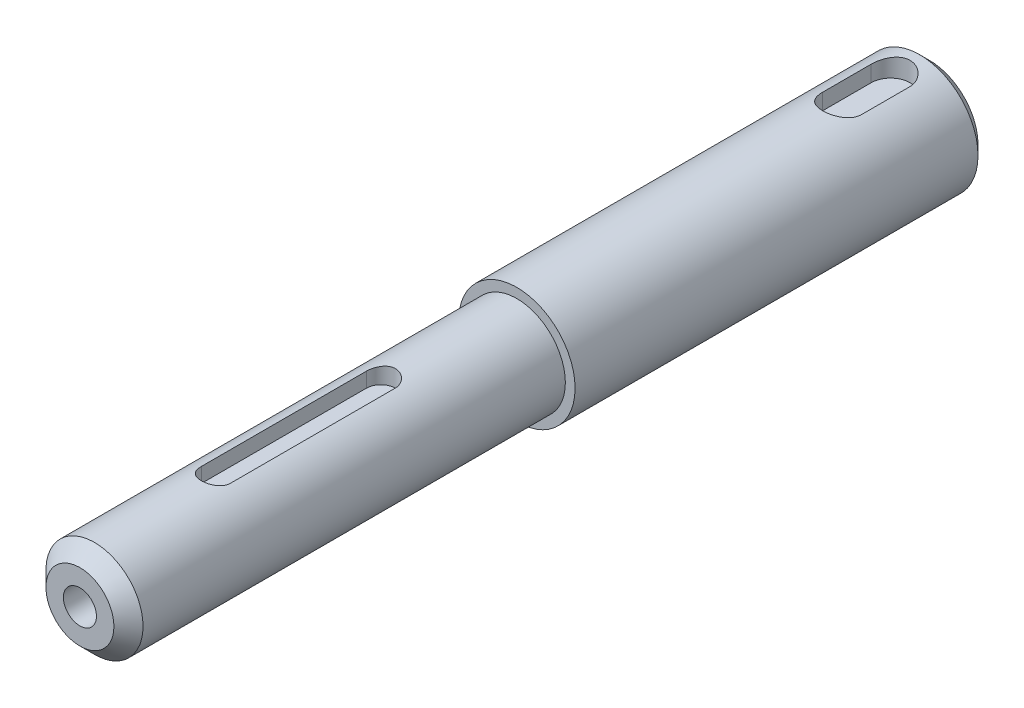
ISO-10303-21;
HEADER;
FILE_DESCRIPTION(('STEP AP214'),'2;1');
FILE_NAME('part.step','',(''),(''),'','','');
FILE_SCHEMA(('AUTOMOTIVE_DESIGN { 1 0 10303 214 1 1 1 1 }'));
ENDSEC;
DATA;
#1=APPLICATION_CONTEXT('core data for automotive mechanical design processes');
#2=APPLICATION_PROTOCOL_DEFINITION('international standard','automotive_design',2000,#1);
#3=PRODUCT_CONTEXT('',#1,'mechanical');
#4=PRODUCT('Part','Part','',(#3));
#5=PRODUCT_RELATED_PRODUCT_CATEGORY('part','',(#4));
#6=PRODUCT_DEFINITION_FORMATION('','',#4);
#7=PRODUCT_DEFINITION_CONTEXT('part definition',#1,'design');
#8=PRODUCT_DEFINITION('design','',#6,#7);
#9=PRODUCT_DEFINITION_SHAPE('','',#8);
#10=(LENGTH_UNIT() NAMED_UNIT(*) SI_UNIT(.MILLI.,.METRE.));
#11=(NAMED_UNIT(*) PLANE_ANGLE_UNIT() SI_UNIT($,.RADIAN.));
#12=(NAMED_UNIT(*) SI_UNIT($,.STERADIAN.) SOLID_ANGLE_UNIT());
#13=UNCERTAINTY_MEASURE_WITH_UNIT(LENGTH_MEASURE(1.E-05),#10,'distance_accuracy_value','');
#14=(GEOMETRIC_REPRESENTATION_CONTEXT(3) GLOBAL_UNCERTAINTY_ASSIGNED_CONTEXT((#13)) GLOBAL_UNIT_ASSIGNED_CONTEXT((#10,
#11,#12)) REPRESENTATION_CONTEXT('',''));
#15=CARTESIAN_POINT('',(0.,0.,0.));
#16=DIRECTION('',(0.,0.,1.));
#17=DIRECTION('',(1.,0.,0.));
#18=AXIS2_PLACEMENT_3D('',#15,#16,#17);
#19=CARTESIAN_POINT('',(0.,0.,85.));
#20=DIRECTION('',(0.,0.,-1.));
#21=DIRECTION('',(-1.,0.,0.));
#22=AXIS2_PLACEMENT_3D('',#19,#20,#21);
#23=CYLINDRICAL_SURFACE('',#22,12.);
#24=CARTESIAN_POINT('',(0.,0.,1.99999999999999));
#25=DIRECTION('',(0.,0.,1.));
#26=DIRECTION('',(1.,0.,0.));
#27=AXIS2_PLACEMENT_3D('',#24,#25,#26);
#28=CIRCLE('',#27,12.);
#29=CARTESIAN_POINT('',(12.,0.,1.99999999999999));
#30=VERTEX_POINT('',#29);
#31=EDGE_CURVE('E163',#30,#30,#28,.T.);
#32=ORIENTED_EDGE('',*,*,#31,.T.);
#33=EDGE_LOOP('',(#32));
#34=FACE_BOUND('',#33,.T.);
#35=CARTESIAN_POINT('',(0.,0.,85.));
#36=DIRECTION('',(0.,0.,1.));
#37=DIRECTION('',(1.,0.,0.));
#38=AXIS2_PLACEMENT_3D('',#35,#36,#37);
#39=CIRCLE('',#38,12.);
#40=CARTESIAN_POINT('',(12.,0.,85.));
#41=VERTEX_POINT('',#40);
#42=EDGE_CURVE('E154',#41,#41,#39,.T.);
#43=ORIENTED_EDGE('',*,*,#42,.F.);
#44=EDGE_LOOP('',(#43));
#45=FACE_BOUND('',#44,.T.);
#46=DIRECTION('',(0.,0.,-1.));
#47=VECTOR('',#46,1.);
#48=CARTESIAN_POINT('',(-3.99999999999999,11.3137084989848,85.));
#49=LINE('',#48,#47);
#50=CARTESIAN_POINT('',(-3.99999999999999,11.3137084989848,8.00000000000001));
#51=VERTEX_POINT('',#50);
#52=CARTESIAN_POINT('',(-4.,11.3137084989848,18.));
#53=VERTEX_POINT('',#52);
#54=EDGE_CURVE('E11',#51,#53,#49,.F.);
#55=ORIENTED_EDGE('',*,*,#54,.F.);
#56=CARTESIAN_POINT('',(0.,12.,4.));
#57=CARTESIAN_POINT('',(-0.218253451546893,12.0000006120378,3.99999898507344));
#58=CARTESIAN_POINT('',(-0.436500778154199,11.9939907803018,4.01792106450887));
#59=CARTESIAN_POINT('',(-0.866567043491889,11.9706084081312,4.08891643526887));
#60=CARTESIAN_POINT('',(-1.07838531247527,11.9532346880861,4.14199337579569));
#61=CARTESIAN_POINT('',(-1.4893311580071,11.9090123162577,4.28127697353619));
#62=CARTESIAN_POINT('',(-1.68847930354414,11.8821795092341,4.36742824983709));
#63=CARTESIAN_POINT('',(-2.0694997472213,11.8217778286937,4.57016469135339));
#64=CARTESIAN_POINT('',(-2.25136862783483,11.7882076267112,4.6867558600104));
#65=CARTESIAN_POINT('',(-2.59896670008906,11.7165637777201,4.95130321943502));
#66=CARTESIAN_POINT('',(-2.76401480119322,11.6783822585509,5.100124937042));
#67=CARTESIAN_POINT('',(-3.06733077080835,11.6024125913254,5.42306861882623));
#68=CARTESIAN_POINT('',(-3.20559274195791,11.5646245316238,5.59719613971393));
#69=CARTESIAN_POINT('',(-3.45529976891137,11.4925332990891,5.97194046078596));
#70=CARTESIAN_POINT('',(-3.56585943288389,11.4583615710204,6.17317495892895));
#71=CARTESIAN_POINT('',(-3.75127549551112,11.3990122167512,6.59270437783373));
#72=CARTESIAN_POINT('',(-3.82614278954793,11.3738318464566,6.81099406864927));
#73=CARTESIAN_POINT('',(-3.93549384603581,11.3364521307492,7.25069288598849));
#74=CARTESIAN_POINT('',(-3.97125379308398,11.3238438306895,7.47174883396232));
#75=CARTESIAN_POINT('',(-4.005364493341,11.3118262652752,7.91705501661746));
#76=CARTESIAN_POINT('',(-4.0037268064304,11.312412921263,8.14130424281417));
#77=CARTESIAN_POINT('',(-3.96407961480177,11.3263605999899,8.57574652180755));
#78=CARTESIAN_POINT('',(-3.92773565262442,11.3391366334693,8.78611361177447));
#79=CARTESIAN_POINT('',(-3.82242465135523,11.3750663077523,9.19757367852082));
#80=CARTESIAN_POINT('',(-3.75345370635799,11.3982211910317,9.39866554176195));
#81=CARTESIAN_POINT('',(-3.58375623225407,11.4527164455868,9.78965099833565));
#82=CARTESIAN_POINT('',(-3.4825361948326,11.4841826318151,9.97931210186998));
#83=CARTESIAN_POINT('',(-3.25155642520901,11.5517023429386,10.339483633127));
#84=CARTESIAN_POINT('',(-3.12178844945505,11.5877571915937,10.5099885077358));
#85=CARTESIAN_POINT('',(-2.82939733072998,11.6626931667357,10.8363663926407));
#86=CARTESIAN_POINT('',(-2.66541260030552,11.7016235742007,10.9910107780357));
#87=CARTESIAN_POINT('',(-2.31335827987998,11.7762775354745,11.2709250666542));
#88=CARTESIAN_POINT('',(-2.12528638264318,11.8120007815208,11.3961921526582));
#89=CARTESIAN_POINT('',(-1.72779045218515,11.8766843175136,11.6147852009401));
#90=CARTESIAN_POINT('',(-1.51817310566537,11.9055740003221,11.7077819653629));
#91=CARTESIAN_POINT('',(-1.08507633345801,11.9528226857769,11.8568126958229));
#92=CARTESIAN_POINT('',(-0.861601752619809,11.971185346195,11.9128595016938));
#93=CARTESIAN_POINT('',(-0.41753531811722,11.9947050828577,11.9842226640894));
#94=CARTESIAN_POINT('',(-0.197238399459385,12.0004000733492,12.001199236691));
#95=CARTESIAN_POINT('',(0.243100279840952,11.9995561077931,11.9986693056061));
#96=CARTESIAN_POINT('',(0.463142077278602,11.9930192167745,11.9791689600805));
#97=CARTESIAN_POINT('',(0.890079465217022,11.9688009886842,11.9055523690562));
#98=CARTESIAN_POINT('',(1.09717122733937,11.9514479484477,11.852455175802));
#99=CARTESIAN_POINT('',(1.49942383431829,11.9076738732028,11.7144262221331));
#100=CARTESIAN_POINT('',(1.69458315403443,11.881251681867,11.6294904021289));
#101=CARTESIAN_POINT('',(2.07315318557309,11.8211572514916,11.4277182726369));
#102=CARTESIAN_POINT('',(2.25611983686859,11.7873125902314,11.3101016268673));
#103=CARTESIAN_POINT('',(2.60025932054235,11.7162101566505,11.0472233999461));
#104=CARTESIAN_POINT('',(2.76142547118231,11.6789513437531,10.9019533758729));
#105=CARTESIAN_POINT('',(3.0650100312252,11.6030739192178,10.5800849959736));
#106=CARTESIAN_POINT('',(3.20624387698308,11.5644704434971,10.4023630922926));
#107=CARTESIAN_POINT('',(3.4570300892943,11.4919989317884,10.0249137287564));
#108=CARTESIAN_POINT('',(3.56658219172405,11.4581309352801,9.8251860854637));
#109=CARTESIAN_POINT('',(3.75038772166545,11.3992956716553,9.40930793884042));
#110=CARTESIAN_POINT('',(3.82471252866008,11.3743104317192,9.19319168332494));
#111=CARTESIAN_POINT('',(3.93557866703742,11.336433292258,8.75048539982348));
#112=CARTESIAN_POINT('',(3.97213701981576,11.3235359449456,8.5239001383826));
#113=CARTESIAN_POINT('',(4.00510512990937,11.3119143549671,8.07921161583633));
#114=CARTESIAN_POINT('',(4.0034810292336,11.3124960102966,7.86127063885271));
#115=CARTESIAN_POINT('',(3.96496917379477,11.3260507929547,7.42893970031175));
#116=CARTESIAN_POINT('',(3.92808351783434,11.3390231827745,7.21454952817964));
#117=CARTESIAN_POINT('',(3.82148725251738,11.3753809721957,6.79945734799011));
#118=CARTESIAN_POINT('',(3.75241338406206,11.3985639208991,6.59857269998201));
#119=CARTESIAN_POINT('',(3.58391746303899,11.4526559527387,6.21109037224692));
#120=CARTESIAN_POINT('',(3.48448867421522,11.4835667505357,6.02449587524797));
#121=CARTESIAN_POINT('',(3.25304277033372,11.5513131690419,5.66206532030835));
#122=CARTESIAN_POINT('',(3.11979297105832,11.5883484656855,5.48705399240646));
#123=CARTESIAN_POINT('',(2.82657153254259,11.6633342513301,5.1612407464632));
#124=CARTESIAN_POINT('',(2.66659233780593,11.7012849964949,5.0104456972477));
#125=CARTESIAN_POINT('',(2.31696622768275,11.7756012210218,4.73142235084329));
#126=CARTESIAN_POINT('',(2.12640605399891,11.8118472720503,4.604302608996));
#127=CARTESIAN_POINT('',(1.7254294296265,11.8770396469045,4.38403828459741));
#128=CARTESIAN_POINT('',(1.51501807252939,11.9059878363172,4.29088501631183));
#129=CARTESIAN_POINT('',(1.0899745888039,11.9522206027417,4.14511347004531));
#130=CARTESIAN_POINT('',(0.875951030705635,11.9699684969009,4.09087013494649));
#131=CARTESIAN_POINT('',(0.441281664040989,11.9938562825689,4.0183188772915));
#132=CARTESIAN_POINT('',(0.220637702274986,11.9999993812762,4.00000102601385));
#133=CARTESIAN_POINT('',(0.,12.,4.));
#134=B_SPLINE_CURVE_WITH_KNOTS('',3,(#56,#57,#58,#59,#60,#61,#62,#63,#64,#65,#66,#67,#68,#69,
#70,#71,#72,#73,#74,#75,#76,#77,#78,#79,#80,#81,#82,#83,#84,#85,#86,#87,#88,#89,#90,#91,#92,#93,
#94,#95,#96,#97,#98,#99,#100,#101,#102,#103,#104,#105,#106,#107,#108,#109,#110,#111,#112,#113,
#114,#115,#116,#117,#118,#119,#120,#121,#122,#123,#124,#125,#126,#127,#128,#129,#130,#131,#132,
#133),.UNSPECIFIED.,.T.,.F.,(4,2,2,2,2,2,2,2,2,2,2,2,2,2,2,2,2,2,2,2,2,2,2,2,2,2,2,2,2,2,2,2,2,
2,2,2,2,2,4),(0.,0.653948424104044,1.30796474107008,1.96089069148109,2.6139455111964,
3.28738737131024,3.96097733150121,4.65393539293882,5.34668178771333,6.0160770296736,
6.68526535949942,7.32387306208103,7.96255723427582,8.61152684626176,9.26068410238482,
9.94373223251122,10.6268458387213,11.3167362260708,12.0063867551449,12.6661433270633,
13.3257885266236,13.9663263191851,14.6069458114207,15.264415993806,15.9220872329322,
16.6096409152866,17.2972003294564,17.9833605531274,18.6692113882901,19.3198266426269,
19.9704031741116,20.6086234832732,21.2469855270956,21.9132026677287,22.5796084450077,
23.2719864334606,23.9641872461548,24.6254623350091,25.2865546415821),.UNSPECIFIED.);
#135=CARTESIAN_POINT('',(4.,11.3137084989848,8.));
#136=VERTEX_POINT('',#135);
#137=EDGE_CURVE('E41',#136,#51,#134,.T.);
#138=ORIENTED_EDGE('',*,*,#137,.F.);
#139=DIRECTION('',(0.,0.,-1.));
#140=VECTOR('',#139,1.);
#141=CARTESIAN_POINT('',(4.00000000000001,11.3137084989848,85.));
#142=LINE('',#141,#140);
#143=CARTESIAN_POINT('',(4.,11.3137084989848,18.));
#144=VERTEX_POINT('',#143);
#145=EDGE_CURVE('E210',#144,#136,#142,.T.);
#146=ORIENTED_EDGE('',*,*,#145,.F.);
#147=CARTESIAN_POINT('',(0.,12.,14.));
#148=CARTESIAN_POINT('',(-0.218253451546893,12.0000006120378,13.9999989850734));
#149=CARTESIAN_POINT('',(-0.436500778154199,11.9939907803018,14.0179210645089));
#150=CARTESIAN_POINT('',(-0.866567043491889,11.9706084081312,14.0889164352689));
#151=CARTESIAN_POINT('',(-1.07838531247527,11.9532346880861,14.1419933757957));
#152=CARTESIAN_POINT('',(-1.4893311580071,11.9090123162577,14.2812769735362));
#153=CARTESIAN_POINT('',(-1.68847930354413,11.8821795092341,14.3674282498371));
#154=CARTESIAN_POINT('',(-2.0694997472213,11.8217778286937,14.5701646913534));
#155=CARTESIAN_POINT('',(-2.25136862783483,11.7882076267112,14.6867558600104));
#156=CARTESIAN_POINT('',(-2.59896670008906,11.7165637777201,14.951303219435));
#157=CARTESIAN_POINT('',(-2.76401480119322,11.6783822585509,15.100124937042));
#158=CARTESIAN_POINT('',(-3.06733077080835,11.6024125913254,15.4230686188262));
#159=CARTESIAN_POINT('',(-3.20559274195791,11.5646245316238,15.5971961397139));
#160=CARTESIAN_POINT('',(-3.45529976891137,11.4925332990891,15.971940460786));
#161=CARTESIAN_POINT('',(-3.56585943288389,11.4583615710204,16.1731749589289));
#162=CARTESIAN_POINT('',(-3.75127549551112,11.3990122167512,16.5927043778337));
#163=CARTESIAN_POINT('',(-3.82614278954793,11.3738318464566,16.8109940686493));
#164=CARTESIAN_POINT('',(-3.93549384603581,11.3364521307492,17.2506928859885));
#165=CARTESIAN_POINT('',(-3.97125379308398,11.3238438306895,17.4717488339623));
#166=CARTESIAN_POINT('',(-4.005364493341,11.3118262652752,17.9170550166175));
#167=CARTESIAN_POINT('',(-4.0037268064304,11.312412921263,18.1413042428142));
#168=CARTESIAN_POINT('',(-3.96407961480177,11.3263605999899,18.5757465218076));
#169=CARTESIAN_POINT('',(-3.92773565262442,11.3391366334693,18.7861136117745));
#170=CARTESIAN_POINT('',(-3.82242465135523,11.3750663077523,19.1975736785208));
#171=CARTESIAN_POINT('',(-3.75345370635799,11.3982211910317,19.3986655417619));
#172=CARTESIAN_POINT('',(-3.58375623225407,11.4527164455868,19.7896509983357));
#173=CARTESIAN_POINT('',(-3.4825361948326,11.4841826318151,19.97931210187));
#174=CARTESIAN_POINT('',(-3.25155642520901,11.5517023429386,20.339483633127));
#175=CARTESIAN_POINT('',(-3.12178844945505,11.5877571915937,20.5099885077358));
#176=CARTESIAN_POINT('',(-2.82939733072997,11.6626931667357,20.8363663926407));
#177=CARTESIAN_POINT('',(-2.66541260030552,11.7016235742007,20.9910107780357));
#178=CARTESIAN_POINT('',(-2.31335827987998,11.7762775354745,21.2709250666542));
#179=CARTESIAN_POINT('',(-2.12528638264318,11.8120007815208,21.3961921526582));
#180=CARTESIAN_POINT('',(-1.72779045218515,11.8766843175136,21.6147852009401));
#181=CARTESIAN_POINT('',(-1.51817310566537,11.9055740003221,21.7077819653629));
#182=CARTESIAN_POINT('',(-1.08507633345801,11.9528226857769,21.8568126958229));
#183=CARTESIAN_POINT('',(-0.86160175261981,11.971185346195,21.9128595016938));
#184=CARTESIAN_POINT('',(-0.417535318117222,11.9947050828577,21.9842226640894));
#185=CARTESIAN_POINT('',(-0.197238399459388,12.0004000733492,22.001199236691));
#186=CARTESIAN_POINT('',(0.24310027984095,11.9995561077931,21.9986693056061));
#187=CARTESIAN_POINT('',(0.463142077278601,11.9930192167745,21.9791689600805));
#188=CARTESIAN_POINT('',(0.890079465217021,11.9688009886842,21.9055523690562));
#189=CARTESIAN_POINT('',(1.09717122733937,11.9514479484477,21.852455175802));
#190=CARTESIAN_POINT('',(1.49942383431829,11.9076738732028,21.7144262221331));
#191=CARTESIAN_POINT('',(1.69458315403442,11.881251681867,21.6294904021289));
#192=CARTESIAN_POINT('',(2.07315318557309,11.8211572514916,21.4277182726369));
#193=CARTESIAN_POINT('',(2.25611983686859,11.7873125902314,21.3101016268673));
#194=CARTESIAN_POINT('',(2.60025932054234,11.7162101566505,21.0472233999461));
#195=CARTESIAN_POINT('',(2.76142547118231,11.6789513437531,20.9019533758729));
#196=CARTESIAN_POINT('',(3.0650100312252,11.6030739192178,20.5800849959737));
#197=CARTESIAN_POINT('',(3.20624387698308,11.5644704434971,20.4023630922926));
#198=CARTESIAN_POINT('',(3.45703008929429,11.4919989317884,20.0249137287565));
#199=CARTESIAN_POINT('',(3.56658219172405,11.4581309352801,19.8251860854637));
#200=CARTESIAN_POINT('',(3.75038772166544,11.3992956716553,19.4093079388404));
#201=CARTESIAN_POINT('',(3.82471252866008,11.3743104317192,19.1931916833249));
#202=CARTESIAN_POINT('',(3.93557866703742,11.336433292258,18.7504853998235));
#203=CARTESIAN_POINT('',(3.97213701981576,11.3235359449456,18.5239001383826));
#204=CARTESIAN_POINT('',(4.00510512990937,11.3119143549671,18.0792116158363));
#205=CARTESIAN_POINT('',(4.0034810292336,11.3124960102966,17.8612706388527));
#206=CARTESIAN_POINT('',(3.96496917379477,11.3260507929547,17.4289397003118));
#207=CARTESIAN_POINT('',(3.92808351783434,11.3390231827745,17.2145495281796));
#208=CARTESIAN_POINT('',(3.82148725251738,11.3753809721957,16.7994573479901));
#209=CARTESIAN_POINT('',(3.75241338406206,11.3985639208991,16.598572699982));
#210=CARTESIAN_POINT('',(3.58391746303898,11.4526559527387,16.2110903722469));
#211=CARTESIAN_POINT('',(3.48448867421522,11.4835667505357,16.024495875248));
#212=CARTESIAN_POINT('',(3.25304277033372,11.5513131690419,15.6620653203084));
#213=CARTESIAN_POINT('',(3.11979297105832,11.5883484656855,15.4870539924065));
#214=CARTESIAN_POINT('',(2.82657153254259,11.6633342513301,15.1612407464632));
#215=CARTESIAN_POINT('',(2.66659233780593,11.7012849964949,15.0104456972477));
#216=CARTESIAN_POINT('',(2.31696622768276,11.7756012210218,14.7314223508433));
#217=CARTESIAN_POINT('',(2.12640605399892,11.8118472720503,14.604302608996));
#218=CARTESIAN_POINT('',(1.7254294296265,11.8770396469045,14.3840382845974));
#219=CARTESIAN_POINT('',(1.5150180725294,11.9059878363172,14.2908850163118));
#220=CARTESIAN_POINT('',(1.0899745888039,11.9522206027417,14.1451134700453));
#221=CARTESIAN_POINT('',(0.875951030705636,11.9699684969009,14.0908701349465));
#222=CARTESIAN_POINT('',(0.441281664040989,11.9938562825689,14.0183188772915));
#223=CARTESIAN_POINT('',(0.220637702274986,11.9999993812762,14.0000010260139));
#224=CARTESIAN_POINT('',(0.,12.,14.));
#225=B_SPLINE_CURVE_WITH_KNOTS('',3,(#147,#148,#149,#150,#151,#152,#153,#154,#155,#156,#157,
#158,#159,#160,#161,#162,#163,#164,#165,#166,#167,#168,#169,#170,#171,#172,#173,#174,#175,#176,
#177,#178,#179,#180,#181,#182,#183,#184,#185,#186,#187,#188,#189,#190,#191,#192,#193,#194,#195,
#196,#197,#198,#199,#200,#201,#202,#203,#204,#205,#206,#207,#208,#209,#210,#211,#212,#213,#214,
#215,#216,#217,#218,#219,#220,#221,#222,#223,#224),.UNSPECIFIED.,.T.,.F.,(4,2,2,2,2,2,2,2,2,2,2,
2,2,2,2,2,2,2,2,2,2,2,2,2,2,2,2,2,2,2,2,2,2,2,2,2,2,2,4),(0.,0.653948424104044,1.30796474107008,
1.96089069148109,2.6139455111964,3.28738737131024,3.96097733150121,4.65393539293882,
5.34668178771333,6.0160770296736,6.68526535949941,7.32387306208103,7.96255723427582,
8.61152684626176,9.26068410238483,9.94373223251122,10.6268458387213,11.3167362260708,
12.0063867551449,12.6661433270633,13.3257885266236,13.9663263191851,14.6069458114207,
15.264415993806,15.9220872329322,16.6096409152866,17.2972003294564,17.9833605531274,
18.6692113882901,19.3198266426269,19.9704031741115,20.6086234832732,21.2469855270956,
21.9132026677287,22.5796084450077,23.2719864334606,23.9641872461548,24.6254623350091,
25.2865546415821),.UNSPECIFIED.);
#226=EDGE_CURVE('E34',#53,#144,#225,.T.);
#227=ORIENTED_EDGE('',*,*,#226,.F.);
#228=EDGE_LOOP('',(#55,#138,#146,#227));
#229=FACE_BOUND('',#228,.T.);
#230=ADVANCED_FACE('F26',(#34,#45,#229),#23,.T.);
#231=CARTESIAN_POINT('',(0.,0.,175.));
#232=DIRECTION('',(0.,0.,-1.));
#233=DIRECTION('',(-1.,0.,0.));
#234=AXIS2_PLACEMENT_3D('',#231,#232,#233);
#235=CYLINDRICAL_SURFACE('',#234,10.);
#236=CARTESIAN_POINT('',(0.,0.,85.));
#237=DIRECTION('',(0.,0.,1.));
#238=DIRECTION('',(1.,0.,0.));
#239=AXIS2_PLACEMENT_3D('',#236,#237,#238);
#240=CIRCLE('',#239,10.);
#241=CARTESIAN_POINT('',(10.,0.,85.));
#242=VERTEX_POINT('',#241);
#243=EDGE_CURVE('E151',#242,#242,#240,.T.);
#244=ORIENTED_EDGE('',*,*,#243,.T.);
#245=EDGE_LOOP('',(#244));
#246=FACE_BOUND('',#245,.T.);
#247=CARTESIAN_POINT('',(0.,0.,172.));
#248=DIRECTION('',(0.,0.,1.));
#249=DIRECTION('',(1.,0.,0.));
#250=AXIS2_PLACEMENT_3D('',#247,#248,#249);
#251=CIRCLE('',#250,10.);
#252=CARTESIAN_POINT('',(10.,0.,172.));
#253=VERTEX_POINT('',#252);
#254=EDGE_CURVE('E160',#253,#253,#251,.F.);
#255=ORIENTED_EDGE('',*,*,#254,.T.);
#256=EDGE_LOOP('',(#255));
#257=FACE_BOUND('',#256,.T.);
#258=CARTESIAN_POINT('',(0.,10.,144.));
#259=CARTESIAN_POINT('',(-0.1645772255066,9.999998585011,144.00000199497));
#260=CARTESIAN_POINT('',(-0.329174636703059,9.99589831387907,144.013587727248));
#261=CARTESIAN_POINT('',(-0.653576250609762,9.97994211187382,144.067442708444));
#262=CARTESIAN_POINT('',(-0.813379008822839,9.96808386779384,144.107719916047));
#263=CARTESIAN_POINT('',(-1.12346541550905,9.93791105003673,144.213492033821));
#264=CARTESIAN_POINT('',(-1.27376272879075,9.91960600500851,144.278949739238));
#265=CARTESIAN_POINT('',(-1.56124836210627,9.8784421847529,144.433072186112));
#266=CARTESIAN_POINT('',(-1.69843493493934,9.85558280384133,144.521740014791));
#267=CARTESIAN_POINT('',(-1.95974359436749,9.80701474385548,144.722448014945));
#268=CARTESIAN_POINT('',(-2.08343614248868,9.78124767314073,144.835033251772));
#269=CARTESIAN_POINT('',(-2.31049841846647,9.73011668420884,145.07921845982));
#270=CARTESIAN_POINT('',(-2.41386472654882,9.70475283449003,145.21082162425));
#271=CARTESIAN_POINT('',(-2.59960075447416,9.65668227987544,145.492941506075));
#272=CARTESIAN_POINT('',(-2.68144618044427,9.63404813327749,145.643816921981));
#273=CARTESIAN_POINT('',(-2.8184278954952,9.59487240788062,145.957978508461));
#274=CARTESIAN_POINT('',(-2.87357059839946,9.57832936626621,146.121261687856));
#275=CARTESIAN_POINT('',(-2.95403267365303,9.55381741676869,146.450780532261));
#276=CARTESIAN_POINT('',(-2.98014392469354,9.54562138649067,146.616805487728));
#277=CARTESIAN_POINT('',(-3.00427461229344,9.53805579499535,146.951066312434));
#278=CARTESIAN_POINT('',(-3.00230085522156,9.53868409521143,147.119301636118));
#279=CARTESIAN_POINT('',(-2.97093954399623,9.54849488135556,147.446767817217));
#280=CARTESIAN_POINT('',(-2.9425441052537,9.55736777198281,147.606104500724));
#281=CARTESIAN_POINT('',(-2.86074840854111,9.58216712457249,147.917639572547));
#282=CARTESIAN_POINT('',(-2.80734568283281,9.59809428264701,148.069837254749));
#283=CARTESIAN_POINT('',(-2.67632053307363,9.63545466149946,148.365200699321));
#284=CARTESIAN_POINT('',(-2.59837633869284,9.65696032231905,148.508214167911));
#285=CARTESIAN_POINT('',(-2.42070445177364,9.7030197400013,148.77946404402));
#286=CARTESIAN_POINT('',(-2.32097148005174,9.72757423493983,148.907696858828));
#287=CARTESIAN_POINT('',(-2.09762581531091,9.77822022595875,149.151372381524));
#288=CARTESIAN_POINT('',(-1.97318981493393,9.80433308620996,149.266057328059));
#289=CARTESIAN_POINT('',(-1.70652651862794,9.85424488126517,149.473107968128));
#290=CARTESIAN_POINT('',(-1.56429810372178,9.8780436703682,149.565472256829));
#291=CARTESIAN_POINT('',(-1.2647100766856,9.92086320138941,149.725719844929));
#292=CARTESIAN_POINT('',(-1.1072554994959,9.93985087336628,149.7934350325));
#293=CARTESIAN_POINT('',(-0.78249083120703,9.97067043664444,149.901199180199));
#294=CARTESIAN_POINT('',(-0.615183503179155,9.98250432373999,149.941255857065));
#295=CARTESIAN_POINT('',(-0.281904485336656,9.99736729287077,149.991304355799));
#296=CARTESIAN_POINT('',(-0.116100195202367,10.0006970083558,150.002323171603));
#297=CARTESIAN_POINT('',(0.214999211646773,9.99905846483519,149.996861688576));
#298=CARTESIAN_POINT('',(0.380294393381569,9.99409131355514,149.980385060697));
#299=CARTESIAN_POINT('',(0.701807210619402,9.97661393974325,149.921230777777));
#300=CARTESIAN_POINT('',(0.858145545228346,9.96427659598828,149.879153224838));
#301=CARTESIAN_POINT('',(1.16150927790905,9.9334869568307,149.770713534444));
#302=CARTESIAN_POINT('',(1.30853355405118,9.91503392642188,149.704348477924));
#303=CARTESIAN_POINT('',(1.59287437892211,9.87339308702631,149.547493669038));
#304=CARTESIAN_POINT('',(1.72988765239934,9.8501056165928,149.456481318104));
#305=CARTESIAN_POINT('',(1.9870466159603,9.80146937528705,149.253550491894));
#306=CARTESIAN_POINT('',(2.10718806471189,9.7761200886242,149.141626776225));
#307=CARTESIAN_POINT('',(2.33171489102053,9.72506343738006,148.895225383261));
#308=CARTESIAN_POINT('',(2.43536962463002,9.69937650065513,148.760076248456));
#309=CARTESIAN_POINT('',(2.61857990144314,9.65153030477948,148.473744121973));
#310=CARTESIAN_POINT('',(2.69813607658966,9.62937095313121,148.322561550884));
#311=CARTESIAN_POINT('',(2.83034694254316,9.5913437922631,148.00893501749));
#312=CARTESIAN_POINT('',(2.88312693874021,9.57544675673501,147.846547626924));
#313=CARTESIAN_POINT('',(2.96043461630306,9.55183188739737,147.514624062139));
#314=CARTESIAN_POINT('',(2.98497197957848,9.54411125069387,147.345090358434));
#315=CARTESIAN_POINT('',(3.0044396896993,9.53799944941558,147.011276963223));
#316=CARTESIAN_POINT('',(3.00056110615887,9.53923294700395,146.847072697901));
#317=CARTESIAN_POINT('',(2.9661501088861,9.54998802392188,146.521771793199));
#318=CARTESIAN_POINT('',(2.93561876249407,9.55950927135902,146.360675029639));
#319=CARTESIAN_POINT('',(2.84953777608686,9.58551527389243,146.048109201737));
#320=CARTESIAN_POINT('',(2.79430351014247,9.60191209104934,145.896545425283));
#321=CARTESIAN_POINT('',(2.66063014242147,9.63980557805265,145.604715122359));
#322=CARTESIAN_POINT('',(2.58218659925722,9.6613032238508,145.464450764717));
#323=CARTESIAN_POINT('',(2.40097527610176,9.70795352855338,145.193673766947));
#324=CARTESIAN_POINT('',(2.29742552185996,9.7332108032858,145.06370247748));
#325=CARTESIAN_POINT('',(2.07034869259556,9.78402640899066,144.822595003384));
#326=CARTESIAN_POINT('',(1.94681643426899,9.80958481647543,144.711463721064));
#327=CARTESIAN_POINT('',(1.67893152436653,9.85901873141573,144.50795317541));
#328=CARTESIAN_POINT('',(1.53407577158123,9.88282319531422,144.416217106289));
#329=CARTESIAN_POINT('',(1.23028274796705,9.92521360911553,144.258529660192));
#330=CARTESIAN_POINT('',(1.07135210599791,9.94380199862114,144.192566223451));
#331=CARTESIAN_POINT('',(0.761515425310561,9.97204349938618,144.094209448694));
#332=CARTESIAN_POINT('',(0.611573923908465,9.9824405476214,144.058976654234));
#333=CARTESIAN_POINT('',(0.307760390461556,9.9964188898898,144.011872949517));
#334=CARTESIAN_POINT('',(0.153889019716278,10.0000013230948,143.99999813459));
#335=CARTESIAN_POINT('',(0.,10.,144.));
#336=B_SPLINE_CURVE_WITH_KNOTS('',3,(#258,#259,#260,#261,#262,#263,#264,#265,#266,#267,#268,
#269,#270,#271,#272,#273,#274,#275,#276,#277,#278,#279,#280,#281,#282,#283,#284,#285,#286,#287,
#288,#289,#290,#291,#292,#293,#294,#295,#296,#297,#298,#299,#300,#301,#302,#303,#304,#305,#306,
#307,#308,#309,#310,#311,#312,#313,#314,#315,#316,#317,#318,#319,#320,#321,#322,#323,#324,#325,
#326,#327,#328,#329,#330,#331,#332,#333,#334,#335),.UNSPECIFIED.,.T.,.F.,(4,2,2,2,2,2,2,2,2,2,2,
2,2,2,2,2,2,2,2,2,2,2,2,2,2,2,2,2,2,2,2,2,2,2,2,2,2,2,4),(0.,0.493166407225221,
0.986479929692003,1.47906735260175,1.9717203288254,2.47711205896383,2.98258874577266,
3.49942962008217,4.01614629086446,4.51839378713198,5.02051956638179,5.50452033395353,
5.98856887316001,6.47924852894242,6.97004720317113,7.48134208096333,7.99266913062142,
8.50742093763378,9.02202907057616,9.5181761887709,10.0142570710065,10.4991349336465,
10.9840710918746,11.4802261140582,11.9765056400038,12.4908080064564,13.0050968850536,
13.516956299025,14.0286401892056,14.5190031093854,15.0093463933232,15.4936008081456,
15.9779479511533,16.4799385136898,16.9820594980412,17.4988599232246,18.0154182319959,
18.4766338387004,18.9377723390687),.UNSPECIFIED.);
#337=CARTESIAN_POINT('',(-2.99999999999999,9.53939201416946,147.));
#338=VERTEX_POINT('',#337);
#339=CARTESIAN_POINT('',(3.,9.53939201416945,147.));
#340=VERTEX_POINT('',#339);
#341=EDGE_CURVE('E202',#338,#340,#336,.T.);
#342=ORIENTED_EDGE('',*,*,#341,.F.);
#343=DIRECTION('',(0.,0.,-1.));
#344=VECTOR('',#343,1.);
#345=CARTESIAN_POINT('',(-2.99999999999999,9.53939201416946,175.));
#346=LINE('',#345,#344);
#347=CARTESIAN_POINT('',(-2.99999999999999,9.53939201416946,113.));
#348=VERTEX_POINT('',#347);
#349=EDGE_CURVE('E169',#348,#338,#346,.F.);
#350=ORIENTED_EDGE('',*,*,#349,.F.);
#351=CARTESIAN_POINT('',(0.,10.,110.));
#352=CARTESIAN_POINT('',(-0.164577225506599,9.999998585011,110.00000199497));
#353=CARTESIAN_POINT('',(-0.329174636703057,9.99589831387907,110.013587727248));
#354=CARTESIAN_POINT('',(-0.65357625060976,9.97994211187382,110.067442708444));
#355=CARTESIAN_POINT('',(-0.813379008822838,9.96808386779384,110.107719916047));
#356=CARTESIAN_POINT('',(-1.12346541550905,9.93791105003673,110.213492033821));
#357=CARTESIAN_POINT('',(-1.27376272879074,9.91960600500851,110.278949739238));
#358=CARTESIAN_POINT('',(-1.56124836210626,9.87844218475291,110.433072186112));
#359=CARTESIAN_POINT('',(-1.69843493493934,9.85558280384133,110.521740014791));
#360=CARTESIAN_POINT('',(-1.95974359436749,9.80701474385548,110.722448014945));
#361=CARTESIAN_POINT('',(-2.08343614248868,9.78124767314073,110.835033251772));
#362=CARTESIAN_POINT('',(-2.31049841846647,9.73011668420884,111.07921845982));
#363=CARTESIAN_POINT('',(-2.41386472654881,9.70475283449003,111.21082162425));
#364=CARTESIAN_POINT('',(-2.59960075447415,9.65668227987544,111.492941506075));
#365=CARTESIAN_POINT('',(-2.68144618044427,9.63404813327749,111.643816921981));
#366=CARTESIAN_POINT('',(-2.8184278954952,9.59487240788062,111.957978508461));
#367=CARTESIAN_POINT('',(-2.87357059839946,9.57832936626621,112.121261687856));
#368=CARTESIAN_POINT('',(-2.95403267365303,9.55381741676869,112.450780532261));
#369=CARTESIAN_POINT('',(-2.98014392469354,9.54562138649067,112.616805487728));
#370=CARTESIAN_POINT('',(-3.00427461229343,9.53805579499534,112.951066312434));
#371=CARTESIAN_POINT('',(-3.00230085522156,9.53868409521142,113.119301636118));
#372=CARTESIAN_POINT('',(-2.97093954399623,9.54849488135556,113.446767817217));
#373=CARTESIAN_POINT('',(-2.9425441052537,9.55736777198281,113.606104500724));
#374=CARTESIAN_POINT('',(-2.86074840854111,9.58216712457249,113.917639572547));
#375=CARTESIAN_POINT('',(-2.80734568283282,9.59809428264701,114.069837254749));
#376=CARTESIAN_POINT('',(-2.67632053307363,9.63545466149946,114.365200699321));
#377=CARTESIAN_POINT('',(-2.59837633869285,9.65696032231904,114.508214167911));
#378=CARTESIAN_POINT('',(-2.42070445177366,9.70301974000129,114.77946404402));
#379=CARTESIAN_POINT('',(-2.32097148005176,9.72757423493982,114.907696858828));
#380=CARTESIAN_POINT('',(-2.09762581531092,9.77822022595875,115.151372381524));
#381=CARTESIAN_POINT('',(-1.97318981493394,9.80433308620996,115.266057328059));
#382=CARTESIAN_POINT('',(-1.70652651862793,9.85424488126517,115.473107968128));
#383=CARTESIAN_POINT('',(-1.56429810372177,9.8780436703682,115.565472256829));
#384=CARTESIAN_POINT('',(-1.2647100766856,9.92086320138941,115.725719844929));
#385=CARTESIAN_POINT('',(-1.1072554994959,9.93985087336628,115.7934350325));
#386=CARTESIAN_POINT('',(-0.782490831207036,9.97067043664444,115.901199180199));
#387=CARTESIAN_POINT('',(-0.615183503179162,9.98250432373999,115.941255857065));
#388=CARTESIAN_POINT('',(-0.281904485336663,9.99736729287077,115.991304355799));
#389=CARTESIAN_POINT('',(-0.116100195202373,10.0006970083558,116.002323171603));
#390=CARTESIAN_POINT('',(0.214999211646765,9.99905846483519,115.996861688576));
#391=CARTESIAN_POINT('',(0.380294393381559,9.99409131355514,115.980385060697));
#392=CARTESIAN_POINT('',(0.701807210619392,9.97661393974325,115.921230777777));
#393=CARTESIAN_POINT('',(0.85814554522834,9.96427659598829,115.879153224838));
#394=CARTESIAN_POINT('',(1.16150927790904,9.9334869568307,115.770713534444));
#395=CARTESIAN_POINT('',(1.30853355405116,9.91503392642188,115.704348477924));
#396=CARTESIAN_POINT('',(1.5928743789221,9.87339308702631,115.547493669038));
#397=CARTESIAN_POINT('',(1.72988765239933,9.8501056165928,115.456481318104));
#398=CARTESIAN_POINT('',(1.9870466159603,9.80146937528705,115.253550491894));
#399=CARTESIAN_POINT('',(2.10718806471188,9.7761200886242,115.141626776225));
#400=CARTESIAN_POINT('',(2.33171489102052,9.72506343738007,114.895225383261));
#401=CARTESIAN_POINT('',(2.43536962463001,9.69937650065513,114.760076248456));
#402=CARTESIAN_POINT('',(2.61857990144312,9.65153030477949,114.473744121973));
#403=CARTESIAN_POINT('',(2.69813607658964,9.62937095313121,114.322561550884));
#404=CARTESIAN_POINT('',(2.83034694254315,9.5913437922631,114.00893501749));
#405=CARTESIAN_POINT('',(2.88312693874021,9.57544675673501,113.846547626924));
#406=CARTESIAN_POINT('',(2.96043461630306,9.55183188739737,113.51462406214));
#407=CARTESIAN_POINT('',(2.98497197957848,9.54411125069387,113.345090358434));
#408=CARTESIAN_POINT('',(3.0044396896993,9.53799944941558,113.011276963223));
#409=CARTESIAN_POINT('',(3.00056110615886,9.53923294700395,112.847072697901));
#410=CARTESIAN_POINT('',(2.9661501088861,9.54998802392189,112.521771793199));
#411=CARTESIAN_POINT('',(2.93561876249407,9.55950927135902,112.360675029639));
#412=CARTESIAN_POINT('',(2.84953777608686,9.58551527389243,112.048109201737));
#413=CARTESIAN_POINT('',(2.79430351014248,9.60191209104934,111.896545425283));
#414=CARTESIAN_POINT('',(2.66063014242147,9.63980557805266,111.604715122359));
#415=CARTESIAN_POINT('',(2.58218659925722,9.6613032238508,111.464450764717));
#416=CARTESIAN_POINT('',(2.40097527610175,9.70795352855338,111.193673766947));
#417=CARTESIAN_POINT('',(2.29742552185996,9.7332108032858,111.06370247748));
#418=CARTESIAN_POINT('',(2.07034869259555,9.78402640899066,110.822595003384));
#419=CARTESIAN_POINT('',(1.94681643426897,9.80958481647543,110.711463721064));
#420=CARTESIAN_POINT('',(1.67893152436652,9.85901873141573,110.50795317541));
#421=CARTESIAN_POINT('',(1.53407577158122,9.88282319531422,110.416217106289));
#422=CARTESIAN_POINT('',(1.23028274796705,9.92521360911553,110.258529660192));
#423=CARTESIAN_POINT('',(1.0713521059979,9.94380199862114,110.192566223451));
#424=CARTESIAN_POINT('',(0.761515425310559,9.97204349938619,110.094209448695));
#425=CARTESIAN_POINT('',(0.611573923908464,9.9824405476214,110.058976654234));
#426=CARTESIAN_POINT('',(0.307760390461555,9.9964188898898,110.011872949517));
#427=CARTESIAN_POINT('',(0.153889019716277,10.0000013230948,109.99999813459));
#428=CARTESIAN_POINT('',(0.,10.,110.));
#429=B_SPLINE_CURVE_WITH_KNOTS('',3,(#351,#352,#353,#354,#355,#356,#357,#358,#359,#360,#361,
#362,#363,#364,#365,#366,#367,#368,#369,#370,#371,#372,#373,#374,#375,#376,#377,#378,#379,#380,
#381,#382,#383,#384,#385,#386,#387,#388,#389,#390,#391,#392,#393,#394,#395,#396,#397,#398,#399,
#400,#401,#402,#403,#404,#405,#406,#407,#408,#409,#410,#411,#412,#413,#414,#415,#416,#417,#418,
#419,#420,#421,#422,#423,#424,#425,#426,#427,#428),.UNSPECIFIED.,.T.,.F.,(4,2,2,2,2,2,2,2,2,2,2,
2,2,2,2,2,2,2,2,2,2,2,2,2,2,2,2,2,2,2,2,2,2,2,2,2,2,2,4),(0.,0.49316640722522,0.986479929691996,
1.47906735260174,1.9717203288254,2.47711205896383,2.98258874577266,3.49942962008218,
4.01614629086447,4.51839378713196,5.02051956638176,5.50452033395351,5.98856887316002,
6.47924852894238,6.9700472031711,7.48134208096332,7.99266913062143,8.50742093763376,
9.02202907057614,9.51817618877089,10.0142570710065,10.4991349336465,10.9840710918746,
11.4802261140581,11.9765056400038,12.4908080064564,13.0050968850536,13.516956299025,
14.0286401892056,14.5190031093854,15.0093463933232,15.4936008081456,15.9779479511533,
16.4799385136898,16.9820594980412,17.4988599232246,18.0154182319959,18.4766338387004,
18.9377723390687),.UNSPECIFIED.);
#430=CARTESIAN_POINT('',(3.,9.53939201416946,113.));
#431=VERTEX_POINT('',#430);
#432=EDGE_CURVE('E171',#431,#348,#429,.T.);
#433=ORIENTED_EDGE('',*,*,#432,.F.);
#434=DIRECTION('',(0.,0.,-1.));
#435=VECTOR('',#434,1.);
#436=CARTESIAN_POINT('',(3.,9.53939201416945,175.));
#437=LINE('',#436,#435);
#438=EDGE_CURVE('E177',#340,#431,#437,.T.);
#439=ORIENTED_EDGE('',*,*,#438,.F.);
#440=EDGE_LOOP('',(#342,#350,#433,#439));
#441=FACE_BOUND('',#440,.T.);
#442=ADVANCED_FACE('F179',(#246,#257,#441),#235,.T.);
#443=CARTESIAN_POINT('',(0.,0.,85.));
#444=DIRECTION('',(0.,0.,1.));
#445=DIRECTION('',(1.,0.,0.));
#446=AXIS2_PLACEMENT_3D('',#443,#444,#445);
#447=PLANE('',#446);
#448=ORIENTED_EDGE('',*,*,#42,.T.);
#449=EDGE_LOOP('',(#448));
#450=FACE_BOUND('',#449,.T.);
#451=ORIENTED_EDGE('',*,*,#243,.F.);
#452=EDGE_LOOP('',(#451));
#453=FACE_BOUND('',#452,.T.);
#454=ADVANCED_FACE('F237',(#450,#453),#447,.T.);
#455=CARTESIAN_POINT('',(0.,0.,0.));
#456=DIRECTION('',(0.,0.,1.));
#457=DIRECTION('',(1.,0.,0.));
#458=AXIS2_PLACEMENT_3D('',#455,#456,#457);
#459=PLANE('',#458);
#460=CARTESIAN_POINT('',(0.,0.,0.));
#461=DIRECTION('',(0.,0.,1.));
#462=DIRECTION('',(1.,0.,0.));
#463=AXIS2_PLACEMENT_3D('',#460,#461,#462);
#464=CIRCLE('',#463,10.);
#465=CARTESIAN_POINT('',(10.,0.,0.));
#466=VERTEX_POINT('',#465);
#467=EDGE_CURVE('E166',#466,#466,#464,.F.);
#468=ORIENTED_EDGE('',*,*,#467,.T.);
#469=EDGE_LOOP('',(#468));
#470=FACE_BOUND('',#469,.T.);
#471=ADVANCED_FACE('F245',(#470),#459,.F.);
#472=CARTESIAN_POINT('',(0.,0.,175.));
#473=DIRECTION('',(0.,0.,1.));
#474=DIRECTION('',(1.,0.,0.));
#475=AXIS2_PLACEMENT_3D('',#472,#473,#474);
#476=PLANE('',#475);
#477=CARTESIAN_POINT('',(0.,0.,175.));
#478=DIRECTION('',(0.,0.,1.));
#479=DIRECTION('',(1.,0.,0.));
#480=AXIS2_PLACEMENT_3D('',#477,#478,#479);
#481=CIRCLE('',#480,3.4);
#482=CARTESIAN_POINT('',(3.4,0.,175.));
#483=VERTEX_POINT('',#482);
#484=EDGE_CURVE('E148',#483,#483,#481,.T.);
#485=ORIENTED_EDGE('',*,*,#484,.F.);
#486=EDGE_LOOP('',(#485));
#487=FACE_BOUND('',#486,.T.);
#488=CARTESIAN_POINT('',(0.,0.,175.));
#489=DIRECTION('',(0.,0.,1.));
#490=DIRECTION('',(1.,0.,0.));
#491=AXIS2_PLACEMENT_3D('',#488,#489,#490);
#492=CIRCLE('',#491,7.);
#493=CARTESIAN_POINT('',(7.,0.,175.));
#494=VERTEX_POINT('',#493);
#495=EDGE_CURVE('E157',#494,#494,#492,.T.);
#496=ORIENTED_EDGE('',*,*,#495,.T.);
#497=EDGE_LOOP('',(#496));
#498=FACE_BOUND('',#497,.T.);
#499=ADVANCED_FACE('F334',(#487,#498),#476,.T.);
#500=CARTESIAN_POINT('',(0.,0.,175.));
#501=DIRECTION('',(0.,0.,-1.));
#502=DIRECTION('',(-1.,0.,0.));
#503=AXIS2_PLACEMENT_3D('',#500,#501,#502);
#504=CONICAL_SURFACE('',#503,7.,0.785398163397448);
#505=ORIENTED_EDGE('',*,*,#254,.F.);
#506=EDGE_LOOP('',(#505));
#507=FACE_BOUND('',#506,.T.);
#508=ORIENTED_EDGE('',*,*,#495,.F.);
#509=EDGE_LOOP('',(#508));
#510=FACE_BOUND('',#509,.T.);
#511=ADVANCED_FACE('F326',(#507,#510),#504,.T.);
#512=CARTESIAN_POINT('',(0.,0.,1.99999999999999));
#513=DIRECTION('',(0.,0.,1.));
#514=DIRECTION('',(1.,0.,0.));
#515=AXIS2_PLACEMENT_3D('',#512,#513,#514);
#516=CONICAL_SURFACE('',#515,12.,0.785398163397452);
#517=ORIENTED_EDGE('',*,*,#467,.F.);
#518=EDGE_LOOP('',(#517));
#519=FACE_BOUND('',#518,.T.);
#520=ORIENTED_EDGE('',*,*,#31,.F.);
#521=EDGE_LOOP('',(#520));
#522=FACE_BOUND('',#521,.T.);
#523=ADVANCED_FACE('F319',(#519,#522),#516,.T.);
#524=CARTESIAN_POINT('',(0.,0.,175.));
#525=DIRECTION('',(0.,0.,1.));
#526=DIRECTION('',(1.,0.,0.));
#527=AXIS2_PLACEMENT_3D('',#524,#525,#526);
#528=CYLINDRICAL_SURFACE('',#527,3.4);
#529=CARTESIAN_POINT('',(0.,0.,153.));
#530=DIRECTION('',(0.,0.,1.));
#531=DIRECTION('',(1.,0.,0.));
#532=AXIS2_PLACEMENT_3D('',#529,#530,#531);
#533=CIRCLE('',#532,3.39999999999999);
#534=CARTESIAN_POINT('',(3.39999999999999,0.,153.));
#535=VERTEX_POINT('',#534);
#536=EDGE_CURVE('E145',#535,#535,#533,.T.);
#537=ORIENTED_EDGE('',*,*,#536,.F.);
#538=EDGE_LOOP('',(#537));
#539=FACE_BOUND('',#538,.T.);
#540=ORIENTED_EDGE('',*,*,#484,.T.);
#541=EDGE_LOOP('',(#540));
#542=FACE_BOUND('',#541,.T.);
#543=ADVANCED_FACE('F312',(#539,#542),#528,.F.);
#544=CARTESIAN_POINT('',(0.,0.,153.));
#545=DIRECTION('',(0.,0.,1.));
#546=DIRECTION('',(1.,0.,0.));
#547=AXIS2_PLACEMENT_3D('',#544,#545,#546);
#548=CONICAL_SURFACE('',#547,3.39999999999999,1.02974425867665);
#549=CARTESIAN_POINT('',(0.,0.,150.957073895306));
#550=VERTEX_POINT('',#549);
#551=VERTEX_LOOP('',#550);
#552=FACE_BOUND('',#551,.T.);
#553=ORIENTED_EDGE('',*,*,#536,.T.);
#554=EDGE_LOOP('',(#553));
#555=FACE_BOUND('',#554,.T.);
#556=ADVANCED_FACE('F199',(#552,#555),#548,.F.);
#557=CARTESIAN_POINT('',(0.,12.,147.));
#558=DIRECTION('',(0.,-1.,0.));
#559=DIRECTION('',(0.,0.,-1.));
#560=AXIS2_PLACEMENT_3D('',#557,#558,#559);
#561=CYLINDRICAL_SURFACE('',#560,3.);
#562=ORIENTED_EDGE('',*,*,#341,.T.);
#563=DIRECTION('',(0.,-1.,0.));
#564=VECTOR('',#563,1.);
#565=CARTESIAN_POINT('',(3.,12.,147.));
#566=LINE('',#565,#564);
#567=CARTESIAN_POINT('',(3.,6.5,147.));
#568=VERTEX_POINT('',#567);
#569=EDGE_CURVE('E143',#340,#568,#566,.T.);
#570=ORIENTED_EDGE('',*,*,#569,.T.);
#571=CARTESIAN_POINT('',(0.,6.5,147.));
#572=DIRECTION('',(0.,1.,0.));
#573=DIRECTION('',(0.,0.,1.));
#574=AXIS2_PLACEMENT_3D('',#571,#572,#573);
#575=CIRCLE('',#574,3.);
#576=CARTESIAN_POINT('',(-2.99999999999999,6.5,147.));
#577=VERTEX_POINT('',#576);
#578=EDGE_CURVE('E103',#577,#568,#575,.T.);
#579=ORIENTED_EDGE('',*,*,#578,.F.);
#580=DIRECTION('',(0.,-1.,0.));
#581=VECTOR('',#580,1.);
#582=CARTESIAN_POINT('',(-2.99999999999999,12.,147.));
#583=LINE('',#582,#581);
#584=EDGE_CURVE('E138',#338,#577,#583,.T.);
#585=ORIENTED_EDGE('',*,*,#584,.F.);
#586=EDGE_LOOP('',(#562,#570,#579,#585));
#587=FACE_BOUND('',#586,.T.);
#588=ADVANCED_FACE('F194',(#587),#561,.F.);
#589=CARTESIAN_POINT('',(3.,12.,147.));
#590=DIRECTION('',(-1.,0.,0.));
#591=DIRECTION('',(0.,0.,1.));
#592=AXIS2_PLACEMENT_3D('',#589,#590,#591);
#593=PLANE('',#592);
#594=ORIENTED_EDGE('',*,*,#438,.T.);
#595=DIRECTION('',(0.,-1.,0.));
#596=VECTOR('',#595,1.);
#597=CARTESIAN_POINT('',(3.,12.,113.));
#598=LINE('',#597,#596);
#599=CARTESIAN_POINT('',(3.,6.5,113.));
#600=VERTEX_POINT('',#599);
#601=EDGE_CURVE('E141',#431,#600,#598,.T.);
#602=ORIENTED_EDGE('',*,*,#601,.T.);
#603=DIRECTION('',(0.,0.,-1.));
#604=VECTOR('',#603,1.);
#605=CARTESIAN_POINT('',(3.,6.5,147.));
#606=LINE('',#605,#604);
#607=EDGE_CURVE('E129',#568,#600,#606,.T.);
#608=ORIENTED_EDGE('',*,*,#607,.F.);
#609=ORIENTED_EDGE('',*,*,#569,.F.);
#610=EDGE_LOOP('',(#594,#602,#608,#609));
#611=FACE_BOUND('',#610,.T.);
#612=ADVANCED_FACE('F189',(#611),#593,.T.);
#613=CARTESIAN_POINT('',(0.,12.,113.));
#614=DIRECTION('',(0.,-1.,0.));
#615=DIRECTION('',(0.,0.,-1.));
#616=AXIS2_PLACEMENT_3D('',#613,#614,#615);
#617=CYLINDRICAL_SURFACE('',#616,3.);
#618=ORIENTED_EDGE('',*,*,#432,.T.);
#619=DIRECTION('',(0.,-1.,0.));
#620=VECTOR('',#619,1.);
#621=CARTESIAN_POINT('',(-3.,12.,113.));
#622=LINE('',#621,#620);
#623=CARTESIAN_POINT('',(-3.,6.5,113.));
#624=VERTEX_POINT('',#623);
#625=EDGE_CURVE('E49',#348,#624,#622,.T.);
#626=ORIENTED_EDGE('',*,*,#625,.T.);
#627=CARTESIAN_POINT('',(0.,6.5,113.));
#628=DIRECTION('',(0.,1.,0.));
#629=DIRECTION('',(0.,0.,1.));
#630=AXIS2_PLACEMENT_3D('',#627,#628,#629);
#631=CIRCLE('',#630,3.);
#632=EDGE_CURVE('E132',#600,#624,#631,.T.);
#633=ORIENTED_EDGE('',*,*,#632,.F.);
#634=ORIENTED_EDGE('',*,*,#601,.F.);
#635=EDGE_LOOP('',(#618,#626,#633,#634));
#636=FACE_BOUND('',#635,.T.);
#637=ADVANCED_FACE('F183',(#636),#617,.F.);
#638=CARTESIAN_POINT('',(-2.99999999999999,12.,147.));
#639=DIRECTION('',(1.,0.,0.));
#640=DIRECTION('',(0.,0.,-1.));
#641=AXIS2_PLACEMENT_3D('',#638,#639,#640);
#642=PLANE('',#641);
#643=ORIENTED_EDGE('',*,*,#349,.T.);
#644=ORIENTED_EDGE('',*,*,#584,.T.);
#645=DIRECTION('',(0.,0.,1.));
#646=VECTOR('',#645,1.);
#647=CARTESIAN_POINT('',(-2.99999999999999,6.5,147.));
#648=LINE('',#647,#646);
#649=EDGE_CURVE('E135',#624,#577,#648,.T.);
#650=ORIENTED_EDGE('',*,*,#649,.F.);
#651=ORIENTED_EDGE('',*,*,#625,.F.);
#652=EDGE_LOOP('',(#643,#644,#650,#651));
#653=FACE_BOUND('',#652,.T.);
#654=ADVANCED_FACE('F188',(#653),#642,.T.);
#655=CARTESIAN_POINT('',(0.,6.5,147.));
#656=DIRECTION('',(0.,1.,0.));
#657=DIRECTION('',(0.,0.,1.));
#658=AXIS2_PLACEMENT_3D('',#655,#656,#657);
#659=PLANE('',#658);
#660=ORIENTED_EDGE('',*,*,#578,.T.);
#661=ORIENTED_EDGE('',*,*,#607,.T.);
#662=ORIENTED_EDGE('',*,*,#632,.T.);
#663=ORIENTED_EDGE('',*,*,#649,.T.);
#664=EDGE_LOOP('',(#660,#661,#662,#663));
#665=FACE_BOUND('',#664,.T.);
#666=ADVANCED_FACE('F222',(#665),#659,.T.);
#667=CARTESIAN_POINT('',(0.,12.,18.));
#668=DIRECTION('',(0.,-1.,0.));
#669=DIRECTION('',(0.,0.,-1.));
#670=AXIS2_PLACEMENT_3D('',#667,#668,#669);
#671=CYLINDRICAL_SURFACE('',#670,4.);
#672=DIRECTION('',(0.,-1.,0.));
#673=VECTOR('',#672,1.);
#674=CARTESIAN_POINT('',(-4.,12.,18.));
#675=LINE('',#674,#673);
#676=CARTESIAN_POINT('',(-4.,8.,18.));
#677=VERTEX_POINT('',#676);
#678=EDGE_CURVE('E122',#53,#677,#675,.T.);
#679=ORIENTED_EDGE('',*,*,#678,.F.);
#680=ORIENTED_EDGE('',*,*,#226,.T.);
#681=DIRECTION('',(0.,-1.,0.));
#682=VECTOR('',#681,1.);
#683=CARTESIAN_POINT('',(4.,12.,18.));
#684=LINE('',#683,#682);
#685=CARTESIAN_POINT('',(4.,8.,18.));
#686=VERTEX_POINT('',#685);
#687=EDGE_CURVE('E95',#144,#686,#684,.T.);
#688=ORIENTED_EDGE('',*,*,#687,.T.);
#689=CARTESIAN_POINT('',(0.,8.,18.));
#690=DIRECTION('',(0.,1.,0.));
#691=DIRECTION('',(0.,0.,1.));
#692=AXIS2_PLACEMENT_3D('',#689,#690,#691);
#693=CIRCLE('',#692,4.);
#694=EDGE_CURVE('E100',#677,#686,#693,.T.);
#695=ORIENTED_EDGE('',*,*,#694,.F.);
#696=EDGE_LOOP('',(#679,#680,#688,#695));
#697=FACE_BOUND('',#696,.T.);
#698=ADVANCED_FACE('F98',(#697),#671,.F.);
#699=CARTESIAN_POINT('',(4.,12.,18.));
#700=DIRECTION('',(-1.,0.,0.));
#701=DIRECTION('',(0.,0.,1.));
#702=AXIS2_PLACEMENT_3D('',#699,#700,#701);
#703=PLANE('',#702);
#704=ORIENTED_EDGE('',*,*,#145,.T.);
#705=DIRECTION('',(0.,-1.,0.));
#706=VECTOR('',#705,1.);
#707=CARTESIAN_POINT('',(4.,12.,8.));
#708=LINE('',#707,#706);
#709=CARTESIAN_POINT('',(4.,8.,8.));
#710=VERTEX_POINT('',#709);
#711=EDGE_CURVE('E104',#136,#710,#708,.T.);
#712=ORIENTED_EDGE('',*,*,#711,.T.);
#713=DIRECTION('',(0.,0.,-1.));
#714=VECTOR('',#713,1.);
#715=CARTESIAN_POINT('',(4.,8.,18.));
#716=LINE('',#715,#714);
#717=EDGE_CURVE('E107',#686,#710,#716,.T.);
#718=ORIENTED_EDGE('',*,*,#717,.F.);
#719=ORIENTED_EDGE('',*,*,#687,.F.);
#720=EDGE_LOOP('',(#704,#712,#718,#719));
#721=FACE_BOUND('',#720,.T.);
#722=ADVANCED_FACE('F108',(#721),#703,.T.);
#723=CARTESIAN_POINT('',(0.,12.,8.));
#724=DIRECTION('',(0.,-1.,0.));
#725=DIRECTION('',(0.,0.,-1.));
#726=AXIS2_PLACEMENT_3D('',#723,#724,#725);
#727=CYLINDRICAL_SURFACE('',#726,4.);
#728=ORIENTED_EDGE('',*,*,#137,.T.);
#729=DIRECTION('',(0.,-1.,0.));
#730=VECTOR('',#729,1.);
#731=CARTESIAN_POINT('',(-4.,12.,8.));
#732=LINE('',#731,#730);
#733=CARTESIAN_POINT('',(-4.,8.,8.));
#734=VERTEX_POINT('',#733);
#735=EDGE_CURVE('E124',#51,#734,#732,.T.);
#736=ORIENTED_EDGE('',*,*,#735,.T.);
#737=CARTESIAN_POINT('',(0.,8.,8.));
#738=DIRECTION('',(0.,1.,0.));
#739=DIRECTION('',(0.,0.,1.));
#740=AXIS2_PLACEMENT_3D('',#737,#738,#739);
#741=CIRCLE('',#740,4.);
#742=EDGE_CURVE('E112',#710,#734,#741,.T.);
#743=ORIENTED_EDGE('',*,*,#742,.F.);
#744=ORIENTED_EDGE('',*,*,#711,.F.);
#745=EDGE_LOOP('',(#728,#736,#743,#744));
#746=FACE_BOUND('',#745,.T.);
#747=ADVANCED_FACE('F211',(#746),#727,.F.);
#748=CARTESIAN_POINT('',(-4.,12.,18.));
#749=DIRECTION('',(1.,0.,0.));
#750=DIRECTION('',(0.,0.,-1.));
#751=AXIS2_PLACEMENT_3D('',#748,#749,#750);
#752=PLANE('',#751);
#753=ORIENTED_EDGE('',*,*,#54,.T.);
#754=ORIENTED_EDGE('',*,*,#678,.T.);
#755=DIRECTION('',(0.,0.,1.));
#756=VECTOR('',#755,1.);
#757=CARTESIAN_POINT('',(-4.,8.,18.));
#758=LINE('',#757,#756);
#759=EDGE_CURVE('E117',#734,#677,#758,.T.);
#760=ORIENTED_EDGE('',*,*,#759,.F.);
#761=ORIENTED_EDGE('',*,*,#735,.F.);
#762=EDGE_LOOP('',(#753,#754,#760,#761));
#763=FACE_BOUND('',#762,.T.);
#764=ADVANCED_FACE('F216',(#763),#752,.T.);
#765=CARTESIAN_POINT('',(0.,8.,18.));
#766=DIRECTION('',(0.,1.,0.));
#767=DIRECTION('',(0.,0.,1.));
#768=AXIS2_PLACEMENT_3D('',#765,#766,#767);
#769=PLANE('',#768);
#770=ORIENTED_EDGE('',*,*,#694,.T.);
#771=ORIENTED_EDGE('',*,*,#717,.T.);
#772=ORIENTED_EDGE('',*,*,#742,.T.);
#773=ORIENTED_EDGE('',*,*,#759,.T.);
#774=EDGE_LOOP('',(#770,#771,#772,#773));
#775=FACE_BOUND('',#774,.T.);
#776=ADVANCED_FACE('F115',(#775),#769,.T.);
#777=CLOSED_SHELL('',(#230,#442,#454,#471,#499,#511,#523,#543,#556,#588,#612,#637,#654,#666,
#698,#722,#747,#764,#776));
#778=MANIFOLD_SOLID_BREP('B2',#777);
#779=ADVANCED_BREP_SHAPE_REPRESENTATION('',(#18,#778),#14);
#780=SHAPE_DEFINITION_REPRESENTATION(#9,#779);
ENDSEC;
END-ISO-10303-21;
